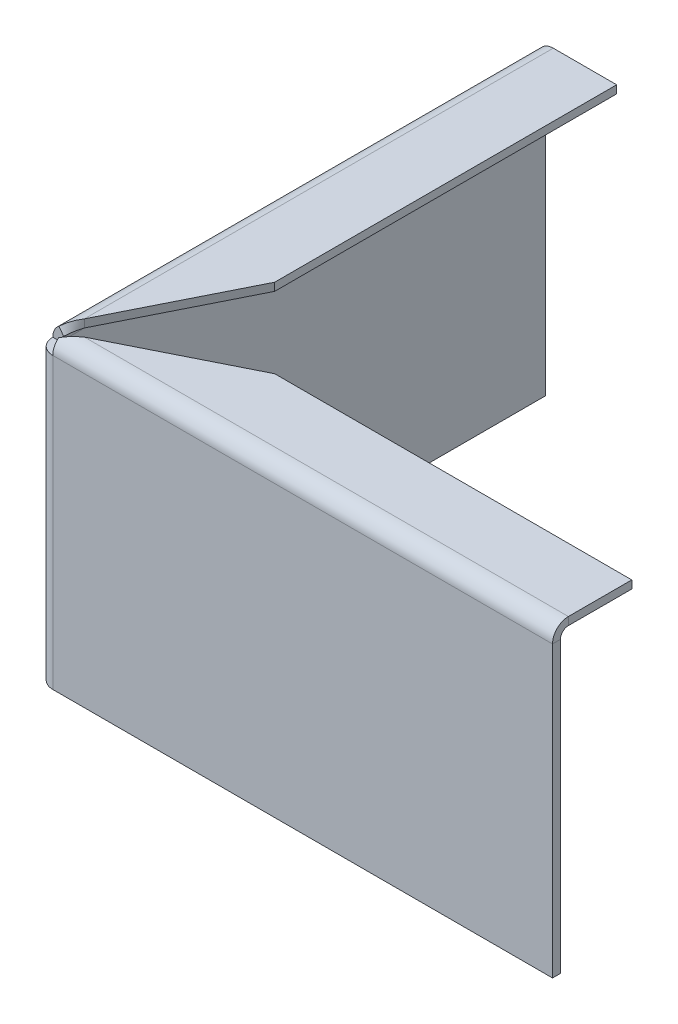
ISO-10303-21;
HEADER;
FILE_DESCRIPTION(('STEP AP214'),'2;1');
FILE_NAME('part.step','',(''),(''),'','','');
FILE_SCHEMA(('AUTOMOTIVE_DESIGN { 1 0 10303 214 1 1 1 1 }'));
ENDSEC;
DATA;
#1=APPLICATION_CONTEXT('core data for automotive mechanical design processes');
#2=APPLICATION_PROTOCOL_DEFINITION('international standard','automotive_design',2000,#1);
#3=PRODUCT_CONTEXT('',#1,'mechanical');
#4=PRODUCT('Part','Part','',(#3));
#5=PRODUCT_RELATED_PRODUCT_CATEGORY('part','',(#4));
#6=PRODUCT_DEFINITION_FORMATION('','',#4);
#7=PRODUCT_DEFINITION_CONTEXT('part definition',#1,'design');
#8=PRODUCT_DEFINITION('design','',#6,#7);
#9=PRODUCT_DEFINITION_SHAPE('','',#8);
#10=(LENGTH_UNIT() NAMED_UNIT(*) SI_UNIT(.MILLI.,.METRE.));
#11=(NAMED_UNIT(*) PLANE_ANGLE_UNIT() SI_UNIT($,.RADIAN.));
#12=(NAMED_UNIT(*) SI_UNIT($,.STERADIAN.) SOLID_ANGLE_UNIT());
#13=UNCERTAINTY_MEASURE_WITH_UNIT(LENGTH_MEASURE(1.E-05),#10,'distance_accuracy_value','');
#14=(GEOMETRIC_REPRESENTATION_CONTEXT(3) GLOBAL_UNCERTAINTY_ASSIGNED_CONTEXT((#13)) GLOBAL_UNIT_ASSIGNED_CONTEXT((#10,
#11,#12)) REPRESENTATION_CONTEXT('',''));
#15=CARTESIAN_POINT('',(0.,0.,0.));
#16=DIRECTION('',(0.,0.,1.));
#17=DIRECTION('',(1.,0.,0.));
#18=AXIS2_PLACEMENT_3D('',#15,#16,#17);
#19=CARTESIAN_POINT('',(65.05375110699,-84.6512975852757,-9.99999999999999));
#20=DIRECTION('',(0.,0.,-1.));
#21=DIRECTION('',(-1.,0.,0.));
#22=AXIS2_PLACEMENT_3D('',#19,#20,#21);
#23=PLANE('',#22);
#24=DIRECTION('',(0.,1.,0.));
#25=VECTOR('',#24,1.);
#26=CARTESIAN_POINT('',(20.,-84.6512975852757,-9.99999999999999));
#27=LINE('',#26,#25);
#28=CARTESIAN_POINT('',(20.,37.5,-9.99999999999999));
#29=VERTEX_POINT('',#28);
#30=CARTESIAN_POINT('',(20.,38.5,-9.99999999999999));
#31=VERTEX_POINT('',#30);
#32=EDGE_CURVE('E573',#29,#31,#27,.T.);
#33=ORIENTED_EDGE('',*,*,#32,.T.);
#34=DIRECTION('',(-1.,0.,0.));
#35=VECTOR('',#34,1.);
#36=CARTESIAN_POINT('',(65.05375110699,38.5,-9.99999999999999));
#37=LINE('',#36,#35);
#38=CARTESIAN_POINT('',(65.05375110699,38.5,-9.99999999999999));
#39=VERTEX_POINT('',#38);
#40=EDGE_CURVE('E567',#39,#31,#37,.T.);
#41=ORIENTED_EDGE('',*,*,#40,.F.);
#42=DIRECTION('',(0.,1.,0.));
#43=VECTOR('',#42,1.);
#44=CARTESIAN_POINT('',(65.05375110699,-84.6512975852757,-9.99999999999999));
#45=LINE('',#44,#43);
#46=CARTESIAN_POINT('',(65.05375110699,37.5,-9.99999999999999));
#47=VERTEX_POINT('',#46);
#48=EDGE_CURVE('E560',#47,#39,#45,.T.);
#49=ORIENTED_EDGE('',*,*,#48,.F.);
#50=DIRECTION('',(-1.,0.,0.));
#51=VECTOR('',#50,1.);
#52=CARTESIAN_POINT('',(65.05375110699,37.5,-9.99999999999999));
#53=LINE('',#52,#51);
#54=EDGE_CURVE('E571',#47,#29,#53,.T.);
#55=ORIENTED_EDGE('',*,*,#54,.T.);
#56=EDGE_LOOP('',(#33,#41,#49,#55));
#57=FACE_BOUND('',#56,.T.);
#58=ADVANCED_FACE('F33',(#57),#23,.T.);
#59=CARTESIAN_POINT('',(2.,-84.6512975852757,-0.999999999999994));
#60=DIRECTION('',(-0.447213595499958,0.,-0.894427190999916));
#61=DIRECTION('',(-0.894427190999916,0.,0.447213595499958));
#62=AXIS2_PLACEMENT_3D('',#59,#60,#61);
#63=PLANE('',#62);
#64=CARTESIAN_POINT('',(4.00000000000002,38.5,-2.));
#65=CARTESIAN_POINT('',(4.00000000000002,37.5,-2.));
#66=B_SPLINE_CURVE_WITH_KNOTS('',1,(#64,#65),.UNSPECIFIED.,.F.,.F.,(2,2),(0.,1.),.UNSPECIFIED.);
#67=CARTESIAN_POINT('',(4.00000000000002,37.5,-2.));
#68=VERTEX_POINT('',#67);
#69=CARTESIAN_POINT('',(4.00000000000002,38.5,-2.));
#70=VERTEX_POINT('',#69);
#71=EDGE_CURVE('E298',#68,#70,#66,.F.);
#72=ORIENTED_EDGE('',*,*,#71,.T.);
#73=DIRECTION('',(-0.894427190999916,0.,0.447213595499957));
#74=VECTOR('',#73,1.);
#75=CARTESIAN_POINT('',(2.,38.5,-0.999999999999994));
#76=LINE('',#75,#74);
#77=EDGE_CURVE('E564',#31,#70,#76,.T.);
#78=ORIENTED_EDGE('',*,*,#77,.F.);
#79=ORIENTED_EDGE('',*,*,#32,.F.);
#80=DIRECTION('',(-0.894427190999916,0.,0.447213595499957));
#81=VECTOR('',#80,1.);
#82=CARTESIAN_POINT('',(2.,37.5,-0.999999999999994));
#83=LINE('',#82,#81);
#84=EDGE_CURVE('E79',#29,#68,#83,.T.);
#85=ORIENTED_EDGE('',*,*,#84,.T.);
#86=EDGE_LOOP('',(#72,#78,#79,#85));
#87=FACE_BOUND('',#86,.T.);
#88=ADVANCED_FACE('F545',(#87),#63,.T.);
#89=CARTESIAN_POINT('',(65.05375110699,38.5,-9.99999999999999));
#90=DIRECTION('',(0.,1.,0.));
#91=DIRECTION('',(0.,0.,1.));
#92=AXIS2_PLACEMENT_3D('',#89,#90,#91);
#93=PLANE('',#92);
#94=DIRECTION('',(-1.,0.,0.));
#95=VECTOR('',#94,1.);
#96=CARTESIAN_POINT('',(4.00000000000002,38.5,-2.));
#97=LINE('',#96,#95);
#98=CARTESIAN_POINT('',(65.05375110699,38.5,-2.));
#99=VERTEX_POINT('',#98);
#100=EDGE_CURVE('E215',#99,#70,#97,.T.);
#101=ORIENTED_EDGE('',*,*,#100,.F.);
#102=DIRECTION('',(0.,0.,1.));
#103=VECTOR('',#102,1.);
#104=CARTESIAN_POINT('',(65.05375110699,38.5,0.));
#105=LINE('',#104,#103);
#106=EDGE_CURVE('E561',#39,#99,#105,.T.);
#107=ORIENTED_EDGE('',*,*,#106,.F.);
#108=ORIENTED_EDGE('',*,*,#40,.T.);
#109=ORIENTED_EDGE('',*,*,#77,.T.);
#110=EDGE_LOOP('',(#101,#107,#108,#109));
#111=FACE_BOUND('',#110,.T.);
#112=ADVANCED_FACE('F550',(#111),#93,.T.);
#113=CARTESIAN_POINT('',(65.05375110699,-84.6512975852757,0.));
#114=DIRECTION('',(1.,0.,0.));
#115=DIRECTION('',(0.,-1.,0.));
#116=AXIS2_PLACEMENT_3D('',#113,#114,#115);
#117=PLANE('',#116);
#118=ORIENTED_EDGE('',*,*,#48,.T.);
#119=ORIENTED_EDGE('',*,*,#106,.T.);
#120=DIRECTION('',(0.,1.,0.));
#121=VECTOR('',#120,1.);
#122=CARTESIAN_POINT('',(65.05375110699,-84.6512975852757,-2.));
#123=LINE('',#122,#121);
#124=CARTESIAN_POINT('',(65.05375110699,37.5,-2.));
#125=VERTEX_POINT('',#124);
#126=EDGE_CURVE('E72',#125,#99,#123,.T.);
#127=ORIENTED_EDGE('',*,*,#126,.F.);
#128=DIRECTION('',(0.,0.,1.));
#129=VECTOR('',#128,1.);
#130=CARTESIAN_POINT('',(65.05375110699,37.5,0.));
#131=LINE('',#130,#129);
#132=EDGE_CURVE('E45',#47,#125,#131,.T.);
#133=ORIENTED_EDGE('',*,*,#132,.F.);
#134=EDGE_LOOP('',(#118,#119,#127,#133));
#135=FACE_BOUND('',#134,.T.);
#136=ADVANCED_FACE('F552',(#135),#117,.T.);
#137=CARTESIAN_POINT('',(65.05375110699,37.5,-9.99999999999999));
#138=DIRECTION('',(0.,1.,0.));
#139=DIRECTION('',(0.,0.,1.));
#140=AXIS2_PLACEMENT_3D('',#137,#138,#139);
#141=PLANE('',#140);
#142=ORIENTED_EDGE('',*,*,#132,.T.);
#143=DIRECTION('',(-1.,0.,0.));
#144=VECTOR('',#143,1.);
#145=CARTESIAN_POINT('',(4.00000000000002,37.5,-2.));
#146=LINE('',#145,#144);
#147=EDGE_CURVE('E11',#125,#68,#146,.T.);
#148=ORIENTED_EDGE('',*,*,#147,.T.);
#149=ORIENTED_EDGE('',*,*,#84,.F.);
#150=ORIENTED_EDGE('',*,*,#54,.F.);
#151=EDGE_LOOP('',(#142,#148,#149,#150));
#152=FACE_BOUND('',#151,.T.);
#153=ADVANCED_FACE('F35',(#152),#141,.F.);
#154=CARTESIAN_POINT('',(9.99999999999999,-80.8702960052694,-63.1465712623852));
#155=DIRECTION('',(1.,0.,0.));
#156=DIRECTION('',(0.,0.,-1.));
#157=AXIS2_PLACEMENT_3D('',#154,#155,#156);
#158=PLANE('',#157);
#159=DIRECTION('',(0.,0.,-1.));
#160=VECTOR('',#159,1.);
#161=CARTESIAN_POINT('',(9.99999999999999,38.5,-63.1465712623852));
#162=LINE('',#161,#160);
#163=CARTESIAN_POINT('',(10.,38.5,-20.));
#164=VERTEX_POINT('',#163);
#165=CARTESIAN_POINT('',(9.99999999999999,38.5,-63.1465712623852));
#166=VERTEX_POINT('',#165);
#167=EDGE_CURVE('E488',#164,#166,#162,.T.);
#168=ORIENTED_EDGE('',*,*,#167,.F.);
#169=DIRECTION('',(0.,1.,0.));
#170=VECTOR('',#169,1.);
#171=CARTESIAN_POINT('',(10.,-80.8702960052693,-20.));
#172=LINE('',#171,#170);
#173=CARTESIAN_POINT('',(10.,37.5,-20.));
#174=VERTEX_POINT('',#173);
#175=EDGE_CURVE('E485',#174,#164,#172,.T.);
#176=ORIENTED_EDGE('',*,*,#175,.F.);
#177=DIRECTION('',(0.,0.,-1.));
#178=VECTOR('',#177,1.);
#179=CARTESIAN_POINT('',(9.99999999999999,37.5,-63.1465712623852));
#180=LINE('',#179,#178);
#181=CARTESIAN_POINT('',(9.99999999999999,37.5,-63.1465712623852));
#182=VERTEX_POINT('',#181);
#183=EDGE_CURVE('E87',#174,#182,#180,.T.);
#184=ORIENTED_EDGE('',*,*,#183,.T.);
#185=DIRECTION('',(0.,1.,0.));
#186=VECTOR('',#185,1.);
#187=CARTESIAN_POINT('',(9.99999999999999,-80.8702960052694,-63.1465712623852));
#188=LINE('',#187,#186);
#189=EDGE_CURVE('E499',#182,#166,#188,.T.);
#190=ORIENTED_EDGE('',*,*,#189,.T.);
#191=EDGE_LOOP('',(#168,#176,#184,#190));
#192=FACE_BOUND('',#191,.T.);
#193=ADVANCED_FACE('F558',(#192),#158,.T.);
#194=CARTESIAN_POINT('',(0.,-80.8702960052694,-63.1465712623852));
#195=DIRECTION('',(0.,0.,-1.));
#196=DIRECTION('',(0.,1.,0.));
#197=AXIS2_PLACEMENT_3D('',#194,#195,#196);
#198=PLANE('',#197);
#199=DIRECTION('',(-1.,0.,0.));
#200=VECTOR('',#199,1.);
#201=CARTESIAN_POINT('',(0.,38.5,-63.1465712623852));
#202=LINE('',#201,#200);
#203=CARTESIAN_POINT('',(1.99999999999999,38.5,-63.1465712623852));
#204=VERTEX_POINT('',#203);
#205=EDGE_CURVE('E111',#166,#204,#202,.T.);
#206=ORIENTED_EDGE('',*,*,#205,.F.);
#207=ORIENTED_EDGE('',*,*,#189,.F.);
#208=DIRECTION('',(-1.,0.,0.));
#209=VECTOR('',#208,1.);
#210=CARTESIAN_POINT('',(0.,37.5,-63.1465712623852));
#211=LINE('',#210,#209);
#212=CARTESIAN_POINT('',(2.,37.5,-63.1465712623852));
#213=VERTEX_POINT('',#212);
#214=EDGE_CURVE('E496',#182,#213,#211,.T.);
#215=ORIENTED_EDGE('',*,*,#214,.T.);
#216=DIRECTION('',(0.,1.,0.));
#217=VECTOR('',#216,1.);
#218=CARTESIAN_POINT('',(2.,-80.8702960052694,-63.1465712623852));
#219=LINE('',#218,#217);
#220=EDGE_CURVE('E494',#213,#204,#219,.T.);
#221=ORIENTED_EDGE('',*,*,#220,.T.);
#222=EDGE_LOOP('',(#206,#207,#215,#221));
#223=FACE_BOUND('',#222,.T.);
#224=ADVANCED_FACE('F659',(#223),#198,.T.);
#225=CARTESIAN_POINT('',(0.,38.5,-2.));
#226=DIRECTION('',(0.,-1.,0.));
#227=DIRECTION('',(0.,0.,-1.));
#228=AXIS2_PLACEMENT_3D('',#225,#226,#227);
#229=PLANE('',#228);
#230=ORIENTED_EDGE('',*,*,#205,.T.);
#231=DIRECTION('',(0.,0.,1.));
#232=VECTOR('',#231,1.);
#233=CARTESIAN_POINT('',(2.,38.5,-63.1465712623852));
#234=LINE('',#233,#232);
#235=CARTESIAN_POINT('',(2.00000000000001,38.5,-4.00000000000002));
#236=VERTEX_POINT('',#235);
#237=EDGE_CURVE('E493',#204,#236,#234,.T.);
#238=ORIENTED_EDGE('',*,*,#237,.T.);
#239=DIRECTION('',(0.447213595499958,0.,-0.894427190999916));
#240=VECTOR('',#239,1.);
#241=CARTESIAN_POINT('',(0.999999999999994,38.5,-2.));
#242=LINE('',#241,#240);
#243=EDGE_CURVE('E491',#236,#164,#242,.T.);
#244=ORIENTED_EDGE('',*,*,#243,.T.);
#245=ORIENTED_EDGE('',*,*,#167,.T.);
#246=EDGE_LOOP('',(#230,#238,#244,#245));
#247=FACE_BOUND('',#246,.T.);
#248=ADVANCED_FACE('F539',(#247),#229,.F.);
#249=CARTESIAN_POINT('',(0.999999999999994,-80.8702960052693,-2.));
#250=DIRECTION('',(0.894427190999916,0.,0.447213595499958));
#251=DIRECTION('',(0.447213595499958,0.,-0.894427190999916));
#252=AXIS2_PLACEMENT_3D('',#249,#250,#251);
#253=PLANE('',#252);
#254=ORIENTED_EDGE('',*,*,#243,.F.);
#255=CARTESIAN_POINT('',(2.,37.5,-4.));
#256=CARTESIAN_POINT('',(2.,38.5,-4.));
#257=B_SPLINE_CURVE_WITH_KNOTS('',1,(#255,#256),.UNSPECIFIED.,.F.,.F.,(2,2),(0.,1.),.UNSPECIFIED.);
#258=CARTESIAN_POINT('',(2.,37.5,-4.));
#259=VERTEX_POINT('',#258);
#260=EDGE_CURVE('E504',#259,#236,#257,.T.);
#261=ORIENTED_EDGE('',*,*,#260,.F.);
#262=DIRECTION('',(0.447213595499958,0.,-0.894427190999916));
#263=VECTOR('',#262,1.);
#264=CARTESIAN_POINT('',(0.999999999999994,37.5,-2.));
#265=LINE('',#264,#263);
#266=EDGE_CURVE('E487',#259,#174,#265,.T.);
#267=ORIENTED_EDGE('',*,*,#266,.T.);
#268=ORIENTED_EDGE('',*,*,#175,.T.);
#269=EDGE_LOOP('',(#254,#261,#267,#268));
#270=FACE_BOUND('',#269,.T.);
#271=ADVANCED_FACE('F528',(#270),#253,.T.);
#272=CARTESIAN_POINT('',(0.,37.5,-2.));
#273=DIRECTION('',(0.,-1.,0.));
#274=DIRECTION('',(0.,0.,-1.));
#275=AXIS2_PLACEMENT_3D('',#272,#273,#274);
#276=PLANE('',#275);
#277=DIRECTION('',(0.,0.,1.));
#278=VECTOR('',#277,1.);
#279=CARTESIAN_POINT('',(2.,37.5,-63.1465712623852));
#280=LINE('',#279,#278);
#281=EDGE_CURVE('E454',#213,#259,#280,.T.);
#282=ORIENTED_EDGE('',*,*,#281,.F.);
#283=ORIENTED_EDGE('',*,*,#214,.F.);
#284=ORIENTED_EDGE('',*,*,#183,.F.);
#285=ORIENTED_EDGE('',*,*,#266,.F.);
#286=EDGE_LOOP('',(#282,#283,#284,#285));
#287=FACE_BOUND('',#286,.T.);
#288=ADVANCED_FACE('F538',(#287),#276,.T.);
#289=CARTESIAN_POINT('',(142.424059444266,37.5,-63.1465712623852));
#290=DIRECTION('',(0.,0.,-1.));
#291=DIRECTION('',(-1.,0.,0.));
#292=AXIS2_PLACEMENT_3D('',#289,#290,#291);
#293=PLANE('',#292);
#294=DIRECTION('',(0.,-1.,0.));
#295=VECTOR('',#294,1.);
#296=CARTESIAN_POINT('',(0.,37.5,-63.1465712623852));
#297=LINE('',#296,#295);
#298=CARTESIAN_POINT('',(0.,36.5,-63.1465712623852));
#299=VERTEX_POINT('',#298);
#300=CARTESIAN_POINT('',(0.,0.,-63.1465712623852));
#301=VERTEX_POINT('',#300);
#302=EDGE_CURVE('E461',#299,#301,#297,.T.);
#303=ORIENTED_EDGE('',*,*,#302,.F.);
#304=DIRECTION('',(-1.,0.,0.));
#305=VECTOR('',#304,1.);
#306=CARTESIAN_POINT('',(142.424059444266,36.5,-63.1465712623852));
#307=LINE('',#306,#305);
#308=CARTESIAN_POINT('',(1.,36.5,-63.1465712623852));
#309=VERTEX_POINT('',#308);
#310=EDGE_CURVE('E478',#309,#299,#307,.T.);
#311=ORIENTED_EDGE('',*,*,#310,.F.);
#312=DIRECTION('',(0.,-1.,0.));
#313=VECTOR('',#312,1.);
#314=CARTESIAN_POINT('',(1.,37.5,-63.1465712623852));
#315=LINE('',#314,#313);
#316=CARTESIAN_POINT('',(1.,0.,-63.1465712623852));
#317=VERTEX_POINT('',#316);
#318=EDGE_CURVE('E471',#309,#317,#315,.T.);
#319=ORIENTED_EDGE('',*,*,#318,.T.);
#320=DIRECTION('',(-1.,0.,0.));
#321=VECTOR('',#320,1.);
#322=CARTESIAN_POINT('',(142.424059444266,0.,-63.1465712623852));
#323=LINE('',#322,#321);
#324=EDGE_CURVE('E468',#317,#301,#323,.T.);
#325=ORIENTED_EDGE('',*,*,#324,.T.);
#326=EDGE_LOOP('',(#303,#311,#319,#325));
#327=FACE_BOUND('',#326,.T.);
#328=ADVANCED_FACE('F543',(#327),#293,.T.);
#329=CARTESIAN_POINT('',(142.424059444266,0.,0.));
#330=DIRECTION('',(0.,-1.,0.));
#331=DIRECTION('',(1.,0.,0.));
#332=AXIS2_PLACEMENT_3D('',#329,#330,#331);
#333=PLANE('',#332);
#334=DIRECTION('',(0.,0.,1.));
#335=VECTOR('',#334,1.);
#336=CARTESIAN_POINT('',(0.,0.,0.));
#337=LINE('',#336,#335);
#338=CARTESIAN_POINT('',(0.,0.,-2.));
#339=VERTEX_POINT('',#338);
#340=EDGE_CURVE('E458',#301,#339,#337,.T.);
#341=ORIENTED_EDGE('',*,*,#340,.F.);
#342=ORIENTED_EDGE('',*,*,#324,.F.);
#343=DIRECTION('',(0.,0.,-1.));
#344=VECTOR('',#343,1.);
#345=CARTESIAN_POINT('',(1.,0.,0.));
#346=LINE('',#345,#344);
#347=CARTESIAN_POINT('',(1.,0.,-2.));
#348=VERTEX_POINT('',#347);
#349=EDGE_CURVE('E118',#317,#348,#346,.F.);
#350=ORIENTED_EDGE('',*,*,#349,.T.);
#351=DIRECTION('',(-1.,0.,0.));
#352=VECTOR('',#351,1.);
#353=CARTESIAN_POINT('',(142.424059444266,0.,-2.));
#354=LINE('',#353,#352);
#355=EDGE_CURVE('E464',#348,#339,#354,.T.);
#356=ORIENTED_EDGE('',*,*,#355,.T.);
#357=EDGE_LOOP('',(#341,#342,#350,#356));
#358=FACE_BOUND('',#357,.T.);
#359=ADVANCED_FACE('F619',(#358),#333,.T.);
#360=CARTESIAN_POINT('',(0.,37.5,0.));
#361=DIRECTION('',(1.,0.,0.));
#362=DIRECTION('',(0.,0.,-1.));
#363=AXIS2_PLACEMENT_3D('',#360,#361,#362);
#364=PLANE('',#363);
#365=DIRECTION('',(0.,0.,1.));
#366=VECTOR('',#365,1.);
#367=CARTESIAN_POINT('',(0.,36.5,-63.1465712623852));
#368=LINE('',#367,#366);
#369=CARTESIAN_POINT('',(0.,36.5,-2.));
#370=VERTEX_POINT('',#369);
#371=EDGE_CURVE('E473',#299,#370,#368,.T.);
#372=ORIENTED_EDGE('',*,*,#371,.F.);
#373=ORIENTED_EDGE('',*,*,#302,.T.);
#374=ORIENTED_EDGE('',*,*,#340,.T.);
#375=DIRECTION('',(0.,1.,0.));
#376=VECTOR('',#375,1.);
#377=CARTESIAN_POINT('',(0.,0.,-2.));
#378=LINE('',#377,#376);
#379=EDGE_CURVE('E455',#339,#370,#378,.T.);
#380=ORIENTED_EDGE('',*,*,#379,.T.);
#381=EDGE_LOOP('',(#372,#373,#374,#380));
#382=FACE_BOUND('',#381,.T.);
#383=ADVANCED_FACE('F615',(#382),#364,.F.);
#384=CARTESIAN_POINT('',(1.,37.5,0.));
#385=DIRECTION('',(1.,0.,0.));
#386=DIRECTION('',(0.,0.,-1.));
#387=AXIS2_PLACEMENT_3D('',#384,#385,#386);
#388=PLANE('',#387);
#389=ORIENTED_EDGE('',*,*,#318,.F.);
#390=DIRECTION('',(0.,0.,1.));
#391=VECTOR('',#390,1.);
#392=CARTESIAN_POINT('',(0.999999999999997,36.5,-63.1465712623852));
#393=LINE('',#392,#391);
#394=CARTESIAN_POINT('',(1.,36.5,-2.));
#395=VERTEX_POINT('',#394);
#396=EDGE_CURVE('E451',#309,#395,#393,.T.);
#397=ORIENTED_EDGE('',*,*,#396,.T.);
#398=DIRECTION('',(0.,1.,0.));
#399=VECTOR('',#398,1.);
#400=CARTESIAN_POINT('',(1.,0.,-2.));
#401=LINE('',#400,#399);
#402=EDGE_CURVE('E450',#348,#395,#401,.T.);
#403=ORIENTED_EDGE('',*,*,#402,.F.);
#404=ORIENTED_EDGE('',*,*,#349,.F.);
#405=EDGE_LOOP('',(#389,#397,#403,#404));
#406=FACE_BOUND('',#405,.T.);
#407=ADVANCED_FACE('F622',(#406),#388,.T.);
#408=CARTESIAN_POINT('',(65.05375110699,37.5,-145.712395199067));
#409=DIRECTION('',(-1.,0.,0.));
#410=DIRECTION('',(0.,0.,1.));
#411=AXIS2_PLACEMENT_3D('',#408,#409,#410);
#412=PLANE('',#411);
#413=DIRECTION('',(0.,0.,1.));
#414=VECTOR('',#413,1.);
#415=CARTESIAN_POINT('',(65.05375110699,36.5,-145.712395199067));
#416=LINE('',#415,#414);
#417=CARTESIAN_POINT('',(65.05375110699,36.5,-1.));
#418=VERTEX_POINT('',#417);
#419=CARTESIAN_POINT('',(65.05375110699,36.5,0.));
#420=VERTEX_POINT('',#419);
#421=EDGE_CURVE('E440',#418,#420,#416,.T.);
#422=ORIENTED_EDGE('',*,*,#421,.T.);
#423=DIRECTION('',(0.,-1.,0.));
#424=VECTOR('',#423,1.);
#425=CARTESIAN_POINT('',(65.05375110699,37.5,0.));
#426=LINE('',#425,#424);
#427=CARTESIAN_POINT('',(65.05375110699,0.,0.));
#428=VERTEX_POINT('',#427);
#429=EDGE_CURVE('E416',#420,#428,#426,.T.);
#430=ORIENTED_EDGE('',*,*,#429,.T.);
#431=DIRECTION('',(0.,0.,1.));
#432=VECTOR('',#431,1.);
#433=CARTESIAN_POINT('',(65.05375110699,0.,-145.712395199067));
#434=LINE('',#433,#432);
#435=CARTESIAN_POINT('',(65.05375110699,0.,-1.));
#436=VERTEX_POINT('',#435);
#437=EDGE_CURVE('E438',#436,#428,#434,.T.);
#438=ORIENTED_EDGE('',*,*,#437,.F.);
#439=DIRECTION('',(0.,-1.,0.));
#440=VECTOR('',#439,1.);
#441=CARTESIAN_POINT('',(65.05375110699,37.5,-1.));
#442=LINE('',#441,#440);
#443=EDGE_CURVE('E428',#418,#436,#442,.T.);
#444=ORIENTED_EDGE('',*,*,#443,.F.);
#445=EDGE_LOOP('',(#422,#430,#438,#444));
#446=FACE_BOUND('',#445,.T.);
#447=ADVANCED_FACE('F600',(#446),#412,.F.);
#448=CARTESIAN_POINT('',(0.,0.,-145.712395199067));
#449=DIRECTION('',(0.,-1.,0.));
#450=DIRECTION('',(0.,0.,-1.));
#451=AXIS2_PLACEMENT_3D('',#448,#449,#450);
#452=PLANE('',#451);
#453=DIRECTION('',(1.,0.,0.));
#454=VECTOR('',#453,1.);
#455=CARTESIAN_POINT('',(0.,0.,0.));
#456=LINE('',#455,#454);
#457=CARTESIAN_POINT('',(2.,0.,0.));
#458=VERTEX_POINT('',#457);
#459=EDGE_CURVE('E447',#458,#428,#456,.T.);
#460=ORIENTED_EDGE('',*,*,#459,.F.);
#461=DIRECTION('',(0.,0.,1.));
#462=VECTOR('',#461,1.);
#463=CARTESIAN_POINT('',(2.,0.,-145.712395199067));
#464=LINE('',#463,#462);
#465=CARTESIAN_POINT('',(2.,0.,-1.));
#466=VERTEX_POINT('',#465);
#467=EDGE_CURVE('E436',#466,#458,#464,.T.);
#468=ORIENTED_EDGE('',*,*,#467,.F.);
#469=DIRECTION('',(1.,0.,0.));
#470=VECTOR('',#469,1.);
#471=CARTESIAN_POINT('',(0.,0.,-1.));
#472=LINE('',#471,#470);
#473=EDGE_CURVE('E444',#466,#436,#472,.T.);
#474=ORIENTED_EDGE('',*,*,#473,.T.);
#475=ORIENTED_EDGE('',*,*,#437,.T.);
#476=EDGE_LOOP('',(#460,#468,#474,#475));
#477=FACE_BOUND('',#476,.T.);
#478=ADVANCED_FACE('F603',(#477),#452,.T.);
#479=CARTESIAN_POINT('',(0.,37.5,-1.));
#480=DIRECTION('',(0.,0.,-1.));
#481=DIRECTION('',(-1.,0.,0.));
#482=AXIS2_PLACEMENT_3D('',#479,#480,#481);
#483=PLANE('',#482);
#484=ORIENTED_EDGE('',*,*,#473,.F.);
#485=DIRECTION('',(0.,1.,0.));
#486=VECTOR('',#485,1.);
#487=CARTESIAN_POINT('',(2.,0.,-1.));
#488=LINE('',#487,#486);
#489=CARTESIAN_POINT('',(2.,36.5,-1.));
#490=VERTEX_POINT('',#489);
#491=EDGE_CURVE('E433',#466,#490,#488,.T.);
#492=ORIENTED_EDGE('',*,*,#491,.T.);
#493=DIRECTION('',(1.,0.,0.));
#494=VECTOR('',#493,1.);
#495=CARTESIAN_POINT('',(2.,36.5,-1.));
#496=LINE('',#495,#494);
#497=EDGE_CURVE('E430',#490,#418,#496,.T.);
#498=ORIENTED_EDGE('',*,*,#497,.T.);
#499=ORIENTED_EDGE('',*,*,#443,.T.);
#500=EDGE_LOOP('',(#484,#492,#498,#499));
#501=FACE_BOUND('',#500,.T.);
#502=ADVANCED_FACE('F596',(#501),#483,.T.);
#503=CARTESIAN_POINT('',(0.,37.5,0.));
#504=DIRECTION('',(0.,0.,-1.));
#505=DIRECTION('',(-1.,0.,0.));
#506=AXIS2_PLACEMENT_3D('',#503,#504,#505);
#507=PLANE('',#506);
#508=DIRECTION('',(0.,1.,0.));
#509=VECTOR('',#508,1.);
#510=CARTESIAN_POINT('',(2.,0.,0.));
#511=LINE('',#510,#509);
#512=CARTESIAN_POINT('',(2.,36.5,0.));
#513=VERTEX_POINT('',#512);
#514=EDGE_CURVE('E425',#458,#513,#511,.T.);
#515=ORIENTED_EDGE('',*,*,#514,.F.);
#516=ORIENTED_EDGE('',*,*,#459,.T.);
#517=ORIENTED_EDGE('',*,*,#429,.F.);
#518=DIRECTION('',(1.,0.,0.));
#519=VECTOR('',#518,1.);
#520=CARTESIAN_POINT('',(2.,36.5,0.));
#521=LINE('',#520,#519);
#522=EDGE_CURVE('E423',#513,#420,#521,.T.);
#523=ORIENTED_EDGE('',*,*,#522,.F.);
#524=EDGE_LOOP('',(#515,#516,#517,#523));
#525=FACE_BOUND('',#524,.T.);
#526=ADVANCED_FACE('F633',(#525),#507,.F.);
#527=CARTESIAN_POINT('',(2.,36.5,-2.));
#528=DIRECTION('',(0.,1.,0.));
#529=DIRECTION('',(0.,0.,1.));
#530=AXIS2_PLACEMENT_3D('',#527,#528,#529);
#531=PLANE('',#530);
#532=DIRECTION('',(0.,0.,1.));
#533=VECTOR('',#532,1.);
#534=CARTESIAN_POINT('',(2.,36.5,-145.712395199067));
#535=LINE('',#534,#533);
#536=EDGE_CURVE('E221',#490,#513,#535,.T.);
#537=ORIENTED_EDGE('',*,*,#536,.F.);
#538=CARTESIAN_POINT('',(2.,36.5,-2.));
#539=DIRECTION('',(0.,1.,0.));
#540=DIRECTION('',(0.,0.,1.));
#541=AXIS2_PLACEMENT_3D('',#538,#539,#540);
#542=CIRCLE('',#541,1.);
#543=EDGE_CURVE('E413',#490,#395,#542,.F.);
#544=ORIENTED_EDGE('',*,*,#543,.T.);
#545=DIRECTION('',(-1.,0.,0.));
#546=VECTOR('',#545,1.);
#547=CARTESIAN_POINT('',(142.424059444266,36.5,-2.));
#548=LINE('',#547,#546);
#549=EDGE_CURVE('E480',#395,#370,#548,.T.);
#550=ORIENTED_EDGE('',*,*,#549,.T.);
#551=CARTESIAN_POINT('',(2.,36.5,-2.));
#552=DIRECTION('',(0.,1.,0.));
#553=DIRECTION('',(0.,0.,1.));
#554=AXIS2_PLACEMENT_3D('',#551,#552,#553);
#555=CIRCLE('',#554,2.);
#556=EDGE_CURVE('E412',#513,#370,#555,.F.);
#557=ORIENTED_EDGE('',*,*,#556,.F.);
#558=EDGE_LOOP('',(#537,#544,#550,#557));
#559=FACE_BOUND('',#558,.T.);
#560=ADVANCED_FACE('F631',(#559),#531,.T.);
#561=CARTESIAN_POINT('',(2.,0.,-2.));
#562=DIRECTION('',(0.,-1.,0.));
#563=DIRECTION('',(0.,0.,-1.));
#564=AXIS2_PLACEMENT_3D('',#561,#562,#563);
#565=PLANE('',#564);
#566=ORIENTED_EDGE('',*,*,#355,.F.);
#567=CARTESIAN_POINT('',(2.,0.,-2.));
#568=DIRECTION('',(0.,1.,0.));
#569=DIRECTION('',(0.,0.,1.));
#570=AXIS2_PLACEMENT_3D('',#567,#568,#569);
#571=CIRCLE('',#570,1.);
#572=EDGE_CURVE('E417',#348,#466,#571,.T.);
#573=ORIENTED_EDGE('',*,*,#572,.T.);
#574=ORIENTED_EDGE('',*,*,#467,.T.);
#575=CARTESIAN_POINT('',(2.,0.,-2.));
#576=DIRECTION('',(0.,1.,0.));
#577=DIRECTION('',(0.,0.,1.));
#578=AXIS2_PLACEMENT_3D('',#575,#576,#577);
#579=CIRCLE('',#578,2.);
#580=EDGE_CURVE('E404',#339,#458,#579,.T.);
#581=ORIENTED_EDGE('',*,*,#580,.F.);
#582=EDGE_LOOP('',(#566,#573,#574,#581));
#583=FACE_BOUND('',#582,.T.);
#584=ADVANCED_FACE('F608',(#583),#565,.T.);
#585=CARTESIAN_POINT('',(2.,-134.955751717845,-2.));
#586=DIRECTION('',(0.,1.,0.));
#587=DIRECTION('',(0.,0.,1.));
#588=AXIS2_PLACEMENT_3D('',#585,#586,#587);
#589=CYLINDRICAL_SURFACE('',#588,2.);
#590=ORIENTED_EDGE('',*,*,#580,.T.);
#591=ORIENTED_EDGE('',*,*,#514,.T.);
#592=ORIENTED_EDGE('',*,*,#556,.T.);
#593=ORIENTED_EDGE('',*,*,#379,.F.);
#594=EDGE_LOOP('',(#590,#591,#592,#593));
#595=FACE_BOUND('',#594,.T.);
#596=ADVANCED_FACE('F611',(#595),#589,.T.);
#597=CARTESIAN_POINT('',(2.,-134.955751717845,-2.));
#598=DIRECTION('',(0.,1.,0.));
#599=DIRECTION('',(0.,0.,1.));
#600=AXIS2_PLACEMENT_3D('',#597,#598,#599);
#601=CYLINDRICAL_SURFACE('',#600,1.);
#602=ORIENTED_EDGE('',*,*,#572,.F.);
#603=ORIENTED_EDGE('',*,*,#402,.T.);
#604=ORIENTED_EDGE('',*,*,#543,.F.);
#605=ORIENTED_EDGE('',*,*,#491,.F.);
#606=EDGE_LOOP('',(#602,#603,#604,#605));
#607=FACE_BOUND('',#606,.T.);
#608=ADVANCED_FACE('F630',(#607),#601,.F.);
#609=CARTESIAN_POINT('',(2.,36.5,-2.));
#610=DIRECTION('',(0.,0.,1.));
#611=DIRECTION('',(0.,-1.,0.));
#612=AXIS2_PLACEMENT_3D('',#609,#610,#611);
#613=PLANE('',#612);
#614=ORIENTED_EDGE('',*,*,#549,.F.);
#615=CARTESIAN_POINT('',(2.,36.5,-2.));
#616=DIRECTION('',(0.,0.,1.));
#617=DIRECTION('',(1.,0.,0.));
#618=AXIS2_PLACEMENT_3D('',#615,#616,#617);
#619=CIRCLE('',#618,0.999999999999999);
#620=CARTESIAN_POINT('',(1.38163019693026,37.285887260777,-2.));
#621=VERTEX_POINT('',#620);
#622=EDGE_CURVE('E310',#395,#621,#619,.F.);
#623=ORIENTED_EDGE('',*,*,#622,.T.);
#624=CARTESIAN_POINT('',(0.763260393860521,38.0717745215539,-2.));
#625=CARTESIAN_POINT('',(1.38163019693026,37.285887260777,-2.));
#626=B_SPLINE_CURVE_WITH_KNOTS('',1,(#624,#625),.UNSPECIFIED.,.F.,.F.,(2,2),(0.,1.),.UNSPECIFIED.);
#627=CARTESIAN_POINT('',(0.763260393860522,38.0717745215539,-2.));
#628=VERTEX_POINT('',#627);
#629=EDGE_CURVE('E392',#621,#628,#626,.F.);
#630=ORIENTED_EDGE('',*,*,#629,.T.);
#631=CARTESIAN_POINT('',(2.,36.5,-2.));
#632=DIRECTION('',(0.,0.,1.));
#633=DIRECTION('',(1.,0.,0.));
#634=AXIS2_PLACEMENT_3D('',#631,#632,#633);
#635=CIRCLE('',#634,2.);
#636=EDGE_CURVE('E627',#370,#628,#635,.F.);
#637=ORIENTED_EDGE('',*,*,#636,.F.);
#638=EDGE_LOOP('',(#614,#623,#630,#637));
#639=FACE_BOUND('',#638,.T.);
#640=ADVANCED_FACE('F366',(#639),#613,.T.);
#641=CARTESIAN_POINT('',(0.763260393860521,38.0717745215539,-2.));
#642=CARTESIAN_POINT('',(0.937907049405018,38.2091940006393,-2.33334295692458));
#643=CARTESIAN_POINT('',(1.13562017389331,38.3172039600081,-2.66666666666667));
#644=CARTESIAN_POINT('',(1.55560103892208,38.4626238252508,-3.33333333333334));
#645=CARTESIAN_POINT('',(1.77777136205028,38.5,-3.66665704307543));
#646=CARTESIAN_POINT('',(2.,38.5,-4.));
#647=CARTESIAN_POINT('',(1.38163019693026,37.285887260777,-2.));
#648=CARTESIAN_POINT('',(1.46895182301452,37.3545956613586,-2.3333364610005));
#649=CARTESIAN_POINT('',(1.56781008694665,37.4086019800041,-2.66666666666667));
#650=CARTESIAN_POINT('',(1.77780051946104,37.4813119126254,-3.33333333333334));
#651=CARTESIAN_POINT('',(1.88888784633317,37.5,-3.6666635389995));
#652=CARTESIAN_POINT('',(2.,37.5,-4.));
#653=B_SPLINE_SURFACE_WITH_KNOTS('',1,3,((#641,#642,#643,#644,#645,#646),(#647,#648,#649,#650,
#651,#652)),.UNSPECIFIED.,.F.,.F.,.F.,(2,2),(4,2,4),(0.,1.),(0.,0.5,1.),.UNSPECIFIED.);
#654=CARTESIAN_POINT('',(1.38163019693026,37.285887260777,-2.));
#655=CARTESIAN_POINT('',(1.46895182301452,37.3545956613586,-2.3333364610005));
#656=CARTESIAN_POINT('',(1.56781008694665,37.4086019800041,-2.66666666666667));
#657=CARTESIAN_POINT('',(1.77780051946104,37.4813119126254,-3.33333333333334));
#658=CARTESIAN_POINT('',(1.88888784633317,37.5,-3.6666635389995));
#659=CARTESIAN_POINT('',(2.,37.5,-4.));
#660=B_SPLINE_CURVE_WITH_KNOTS('',3,(#654,#655,#656,#657,#658,#659),.UNSPECIFIED.,.F.,.F.,(4,2,
4),(0.,0.5,1.),.UNSPECIFIED.);
#661=EDGE_CURVE('E312',#621,#259,#660,.T.);
#662=CARTESIAN_POINT('',(2.,38.5,-4.));
#663=CARTESIAN_POINT('',(1.77777136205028,38.5,-3.66665704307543));
#664=CARTESIAN_POINT('',(1.55560103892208,38.4626238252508,-3.33333333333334));
#665=CARTESIAN_POINT('',(1.13562017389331,38.3172039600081,-2.66666666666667));
#666=CARTESIAN_POINT('',(0.937907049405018,38.2091940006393,-2.33334295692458));
#667=CARTESIAN_POINT('',(0.763260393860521,38.0717745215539,-2.));
#668=B_SPLINE_CURVE_WITH_KNOTS('',3,(#662,#663,#664,#665,#666,#667),.UNSPECIFIED.,.F.,.F.,(4,2,
4),(0.,0.5,1.),.UNSPECIFIED.);
#669=EDGE_CURVE('E102',#628,#236,#668,.F.);
#670=ORIENTED_EDGE('',*,*,#629,.F.);
#671=ORIENTED_EDGE('',*,*,#661,.T.);
#672=ORIENTED_EDGE('',*,*,#260,.T.);
#673=ORIENTED_EDGE('',*,*,#669,.F.);
#674=EDGE_LOOP('',(#670,#671,#672,#673));
#675=FACE_BOUND('',#674,.T.);
#676=ADVANCED_FACE('F355',(#675),#653,.T.);
#677=CARTESIAN_POINT('',(2.,36.5,-63.1465712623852));
#678=DIRECTION('',(0.,0.,-1.));
#679=DIRECTION('',(-1.,0.,0.));
#680=AXIS2_PLACEMENT_3D('',#677,#678,#679);
#681=PLANE('',#680);
#682=ORIENTED_EDGE('',*,*,#220,.F.);
#683=CARTESIAN_POINT('',(2.,36.5,-63.1465712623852));
#684=DIRECTION('',(0.,0.,1.));
#685=DIRECTION('',(1.,0.,0.));
#686=AXIS2_PLACEMENT_3D('',#683,#684,#685);
#687=CIRCLE('',#686,0.999999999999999);
#688=EDGE_CURVE('E202',#213,#309,#687,.T.);
#689=ORIENTED_EDGE('',*,*,#688,.T.);
#690=ORIENTED_EDGE('',*,*,#310,.T.);
#691=CARTESIAN_POINT('',(2.,36.5,-63.1465712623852));
#692=DIRECTION('',(0.,0.,1.));
#693=DIRECTION('',(1.,0.,0.));
#694=AXIS2_PLACEMENT_3D('',#691,#692,#693);
#695=CIRCLE('',#694,2.);
#696=EDGE_CURVE('E302',#204,#299,#695,.T.);
#697=ORIENTED_EDGE('',*,*,#696,.F.);
#698=EDGE_LOOP('',(#682,#689,#690,#697));
#699=FACE_BOUND('',#698,.T.);
#700=ADVANCED_FACE('F326',(#699),#681,.T.);
#701=CARTESIAN_POINT('',(2.,36.5,-165.200395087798));
#702=DIRECTION('',(0.,0.,1.));
#703=DIRECTION('',(1.,0.,0.));
#704=AXIS2_PLACEMENT_3D('',#701,#702,#703);
#705=CYLINDRICAL_SURFACE('',#704,2.);
#706=ORIENTED_EDGE('',*,*,#696,.T.);
#707=ORIENTED_EDGE('',*,*,#371,.T.);
#708=ORIENTED_EDGE('',*,*,#636,.T.);
#709=ORIENTED_EDGE('',*,*,#669,.T.);
#710=ORIENTED_EDGE('',*,*,#237,.F.);
#711=EDGE_LOOP('',(#706,#707,#708,#709,#710));
#712=FACE_BOUND('',#711,.T.);
#713=ADVANCED_FACE('F316',(#712),#705,.T.);
#714=CARTESIAN_POINT('',(2.,36.5,-165.200395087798));
#715=DIRECTION('',(0.,0.,1.));
#716=DIRECTION('',(1.,0.,0.));
#717=AXIS2_PLACEMENT_3D('',#714,#715,#716);
#718=CYLINDRICAL_SURFACE('',#717,0.999999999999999);
#719=ORIENTED_EDGE('',*,*,#688,.F.);
#720=ORIENTED_EDGE('',*,*,#281,.T.);
#721=ORIENTED_EDGE('',*,*,#661,.F.);
#722=ORIENTED_EDGE('',*,*,#622,.F.);
#723=ORIENTED_EDGE('',*,*,#396,.F.);
#724=EDGE_LOOP('',(#719,#720,#721,#722,#723));
#725=FACE_BOUND('',#724,.T.);
#726=ADVANCED_FACE('F325',(#725),#718,.F.);
#727=CARTESIAN_POINT('',(65.05375110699,36.5,-2.));
#728=DIRECTION('',(1.,0.,0.));
#729=DIRECTION('',(0.,0.,-1.));
#730=AXIS2_PLACEMENT_3D('',#727,#728,#729);
#731=PLANE('',#730);
#732=ORIENTED_EDGE('',*,*,#421,.F.);
#733=CARTESIAN_POINT('',(65.05375110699,36.5,-2.));
#734=DIRECTION('',(1.,0.,0.));
#735=DIRECTION('',(0.,0.,-1.));
#736=AXIS2_PLACEMENT_3D('',#733,#734,#735);
#737=CIRCLE('',#736,0.999999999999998);
#738=EDGE_CURVE('E222',#418,#125,#737,.F.);
#739=ORIENTED_EDGE('',*,*,#738,.T.);
#740=ORIENTED_EDGE('',*,*,#126,.T.);
#741=CARTESIAN_POINT('',(65.05375110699,36.5,-2.));
#742=DIRECTION('',(1.,0.,0.));
#743=DIRECTION('',(0.,0.,-1.));
#744=AXIS2_PLACEMENT_3D('',#741,#742,#743);
#745=CIRCLE('',#744,2.);
#746=EDGE_CURVE('E203',#420,#99,#745,.F.);
#747=ORIENTED_EDGE('',*,*,#746,.F.);
#748=EDGE_LOOP('',(#732,#739,#740,#747));
#749=FACE_BOUND('',#748,.T.);
#750=ADVANCED_FACE('F269',(#749),#731,.T.);
#751=CARTESIAN_POINT('',(4.00000000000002,38.5,-2.));
#752=CARTESIAN_POINT('',(3.66665704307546,38.5,-1.7777713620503));
#753=CARTESIAN_POINT('',(3.33333333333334,38.4626238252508,-1.55560103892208));
#754=CARTESIAN_POINT('',(2.66666666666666,38.3172039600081,-1.13562017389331));
#755=CARTESIAN_POINT('',(2.33334295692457,38.2091940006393,-0.93790704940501));
#756=CARTESIAN_POINT('',(2.,38.0717745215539,-0.763260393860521));
#757=CARTESIAN_POINT('',(4.00000000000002,37.5,-2.));
#758=CARTESIAN_POINT('',(3.66666353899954,37.5,-1.88888784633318));
#759=CARTESIAN_POINT('',(3.33333333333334,37.4813119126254,-1.77780051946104));
#760=CARTESIAN_POINT('',(2.66666666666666,37.4086019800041,-1.56781008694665));
#761=CARTESIAN_POINT('',(2.33333646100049,37.3545956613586,-1.46895182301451));
#762=CARTESIAN_POINT('',(2.,37.285887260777,-1.38163019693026));
#763=B_SPLINE_SURFACE_WITH_KNOTS('',1,3,((#751,#752,#753,#754,#755,#756),(#757,#758,#759,#760,
#761,#762)),.UNSPECIFIED.,.F.,.F.,.F.,(2,2),(4,2,4),(0.,1.),(0.,0.5,1.),.UNSPECIFIED.);
#764=CARTESIAN_POINT('',(4.00000000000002,37.5,-2.));
#765=CARTESIAN_POINT('',(3.66666353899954,37.5,-1.88888784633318));
#766=CARTESIAN_POINT('',(3.33333333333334,37.4813119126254,-1.77780051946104));
#767=CARTESIAN_POINT('',(2.66666666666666,37.4086019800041,-1.56781008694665));
#768=CARTESIAN_POINT('',(2.33333646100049,37.3545956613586,-1.46895182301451));
#769=CARTESIAN_POINT('',(2.,37.285887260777,-1.38163019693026));
#770=B_SPLINE_CURVE_WITH_KNOTS('',3,(#764,#765,#766,#767,#768,#769),.UNSPECIFIED.,.F.,.F.,(4,2,
4),(0.,0.5,1.),.UNSPECIFIED.);
#771=CARTESIAN_POINT('',(2.,37.2858872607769,-1.38163019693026));
#772=VERTEX_POINT('',#771);
#773=EDGE_CURVE('E196',#68,#772,#770,.T.);
#774=CARTESIAN_POINT('',(2.,37.285887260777,-1.38163019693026));
#775=CARTESIAN_POINT('',(2.,38.0717745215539,-0.763260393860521));
#776=B_SPLINE_CURVE_WITH_KNOTS('',1,(#774,#775),.UNSPECIFIED.,.F.,.F.,(2,2),(0.,1.),.UNSPECIFIED.);
#777=CARTESIAN_POINT('',(2.,38.0717745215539,-0.763260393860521));
#778=VERTEX_POINT('',#777);
#779=EDGE_CURVE('E188',#772,#778,#776,.T.);
#780=CARTESIAN_POINT('',(2.,38.0717745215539,-0.763260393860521));
#781=CARTESIAN_POINT('',(2.33334295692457,38.2091940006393,-0.93790704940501));
#782=CARTESIAN_POINT('',(2.66666666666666,38.3172039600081,-1.13562017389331));
#783=CARTESIAN_POINT('',(3.33333333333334,38.4626238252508,-1.55560103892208));
#784=CARTESIAN_POINT('',(3.66665704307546,38.5,-1.7777713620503));
#785=CARTESIAN_POINT('',(4.00000000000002,38.5,-2.));
#786=B_SPLINE_CURVE_WITH_KNOTS('',3,(#780,#781,#782,#783,#784,#785),.UNSPECIFIED.,.F.,.F.,(4,2,
4),(0.,0.5,1.),.UNSPECIFIED.);
#787=EDGE_CURVE('E193',#70,#778,#786,.F.);
#788=ORIENTED_EDGE('',*,*,#71,.F.);
#789=ORIENTED_EDGE('',*,*,#773,.T.);
#790=ORIENTED_EDGE('',*,*,#779,.T.);
#791=ORIENTED_EDGE('',*,*,#787,.F.);
#792=EDGE_LOOP('',(#788,#789,#790,#791));
#793=FACE_BOUND('',#792,.T.);
#794=ADVANCED_FACE('F192',(#793),#763,.T.);
#795=CARTESIAN_POINT('',(2.,36.5,-2.));
#796=DIRECTION('',(-1.,0.,0.));
#797=DIRECTION('',(0.,0.,1.));
#798=AXIS2_PLACEMENT_3D('',#795,#796,#797);
#799=PLANE('',#798);
#800=ORIENTED_EDGE('',*,*,#779,.F.);
#801=CARTESIAN_POINT('',(2.,36.5,-2.));
#802=DIRECTION('',(1.,0.,0.));
#803=DIRECTION('',(0.,0.,-1.));
#804=AXIS2_PLACEMENT_3D('',#801,#802,#803);
#805=CIRCLE('',#804,0.999999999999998);
#806=EDGE_CURVE('E882',#772,#490,#805,.T.);
#807=ORIENTED_EDGE('',*,*,#806,.T.);
#808=ORIENTED_EDGE('',*,*,#536,.T.);
#809=CARTESIAN_POINT('',(2.,36.5,-2.));
#810=DIRECTION('',(1.,0.,0.));
#811=DIRECTION('',(0.,0.,-1.));
#812=AXIS2_PLACEMENT_3D('',#809,#810,#811);
#813=CIRCLE('',#812,2.);
#814=EDGE_CURVE('E212',#778,#513,#813,.T.);
#815=ORIENTED_EDGE('',*,*,#814,.F.);
#816=EDGE_LOOP('',(#800,#807,#808,#815));
#817=FACE_BOUND('',#816,.T.);
#818=ADVANCED_FACE('F219',(#817),#799,.T.);
#819=CARTESIAN_POINT('',(-100.05385523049,36.5,-2.));
#820=DIRECTION('',(1.,0.,0.));
#821=DIRECTION('',(0.,0.,-1.));
#822=AXIS2_PLACEMENT_3D('',#819,#820,#821);
#823=CYLINDRICAL_SURFACE('',#822,2.);
#824=ORIENTED_EDGE('',*,*,#814,.T.);
#825=ORIENTED_EDGE('',*,*,#522,.T.);
#826=ORIENTED_EDGE('',*,*,#746,.T.);
#827=ORIENTED_EDGE('',*,*,#100,.T.);
#828=ORIENTED_EDGE('',*,*,#787,.T.);
#829=EDGE_LOOP('',(#824,#825,#826,#827,#828));
#830=FACE_BOUND('',#829,.T.);
#831=ADVANCED_FACE('F210',(#830),#823,.T.);
#832=CARTESIAN_POINT('',(-100.05385523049,36.5,-2.));
#833=DIRECTION('',(1.,0.,0.));
#834=DIRECTION('',(0.,0.,-1.));
#835=AXIS2_PLACEMENT_3D('',#832,#833,#834);
#836=CYLINDRICAL_SURFACE('',#835,0.999999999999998);
#837=ORIENTED_EDGE('',*,*,#806,.F.);
#838=ORIENTED_EDGE('',*,*,#773,.F.);
#839=ORIENTED_EDGE('',*,*,#147,.F.);
#840=ORIENTED_EDGE('',*,*,#738,.F.);
#841=ORIENTED_EDGE('',*,*,#497,.F.);
#842=EDGE_LOOP('',(#837,#838,#839,#840,#841));
#843=FACE_BOUND('',#842,.T.);
#844=ADVANCED_FACE('F241',(#843),#836,.F.);
#845=CLOSED_SHELL('',(#58,#88,#112,#136,#153,#193,#224,#248,#271,#288,#328,#359,#383,#407,#447,
#478,#502,#526,#560,#584,#596,#608,#640,#676,#700,#713,#726,#750,#794,#818,#831,#844));
#846=MANIFOLD_SOLID_BREP('B2',#845);
#847=ADVANCED_BREP_SHAPE_REPRESENTATION('',(#18,#846),#14);
#848=SHAPE_DEFINITION_REPRESENTATION(#9,#847);
ENDSEC;
END-ISO-10303-21;
